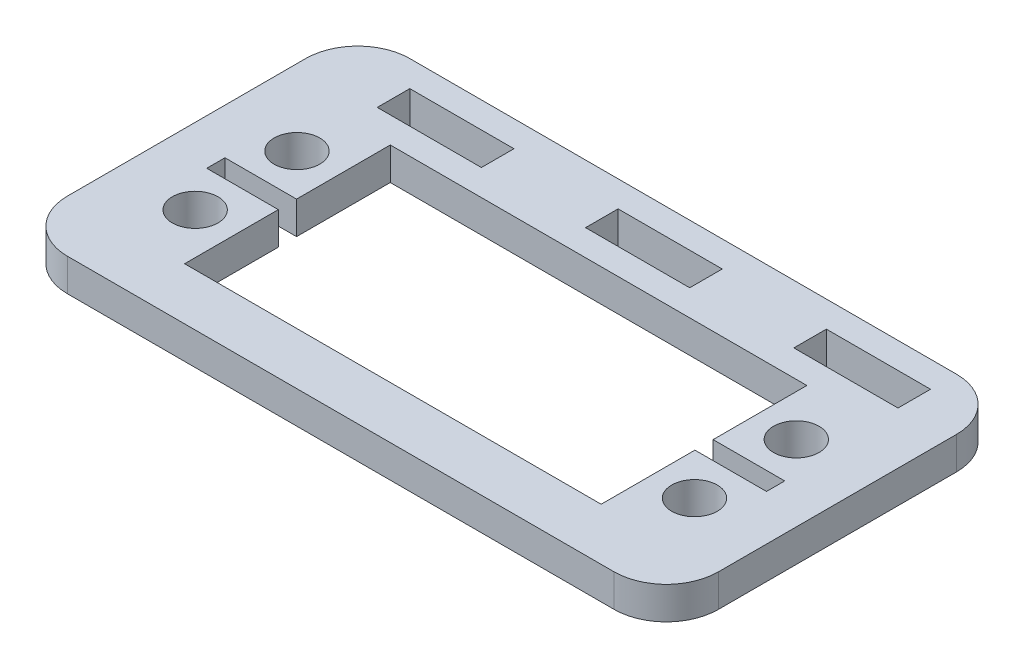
from build123d import *

# Parameters (mm, degrees)
SKETCH1_W            = 63.5
SKETCH1_H            = 33.401
SKETCH1_W_2          = 10.16
SKETCH1_H_2          = 3.175
SKETCH1_W_3          = 40.64
SKETCH1_H_3          = 20.066
MAIN_EXTRUSION_DEPTH = 3.175
SKETCH3_R            = 2.2225
MOUNTING_HOLES_DEPTH = 37.777630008
TAB_CUTOUT_DEPTH     = 37.777630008
FILLET1_R            = 5.08


with BuildPart() as part:
    # Sketch1 → Main Extrusion (new body)
    with BuildSketch(Plane(origin=(0, 0, 0), x_dir=(1, 0, 0), z_dir=(0, 1, 0))):
        with Locations((0, 1.5875)):
            Rectangle(SKETCH1_W, SKETCH1_H)
        with Locations((21.59, 14.1605)):
            Rectangle(SKETCH1_W_2, SKETCH1_H_2, mode=Mode.SUBTRACT)
        with Locations((1.27, 14.1605)):
            Rectangle(SKETCH1_W_2, SKETCH1_H_2, mode=Mode.SUBTRACT)
        with Locations((-19.05, 14.1605)):
            Rectangle(SKETCH1_W_2, SKETCH1_H_2, mode=Mode.SUBTRACT)
        Rectangle(SKETCH1_W_3, SKETCH1_H_3, mode=Mode.SUBTRACT)
    extrude(amount=MAIN_EXTRUSION_DEPTH)

    # Sketch3 → Mounting Holes (cut, through all)
    with BuildSketch(Plane(origin=(0, 3.175, 0), x_dir=(1, 0, 0), z_dir=(0, 1, 0))):
        with Locations(Location((-24.357246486, 4.9657, 0), (0, 0, 270))):
            Circle(SKETCH3_R)
        with Locations(Location((-24.357246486, -4.9657, 0), (0, 0, 270))):
            Circle(SKETCH3_R)
        with Locations(Location((24.357246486, -4.9657, 0), (0, 0, 90))):
            Circle(SKETCH3_R)
        with Locations(Location((24.357246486, 4.9657, 0), (0, 0, 90))):
            Circle(SKETCH3_R)
    extrude(amount=-MOUNTING_HOLES_DEPTH, mode=Mode.SUBTRACT)

    # Sketch5 → Tab cutout (cut, through all)
    with BuildSketch(Plane(origin=(0, 3.175, 0), x_dir=(1, 0, 0), z_dir=(0, 1, 0))):
        Polygon((-20.32, 0), (-20.32, 0.889), (-27.305, 0.889), (-27.305, -0.889), (-20.32, -0.889), align=None)
        Polygon((27.305, -0.889), (20.32, -0.889), (20.32, 0), (20.32, 0.889), (27.305, 0.889), align=None)
    extrude(amount=-TAB_CUTOUT_DEPTH, mode=Mode.SUBTRACT)

    # Fillet1
    fillet1_edges = [part.edges().sort_by_distance(p)[0] for p in [
        (31.75, 1.5875, 15.113),
        (-31.75, 1.5875, 15.113),
        (-31.75, 1.5875, -18.288),
        (31.75, 1.5875, -18.288),
    ]]
    fillet(fillet1_edges, radius=FILLET1_R)


solid = part.part
